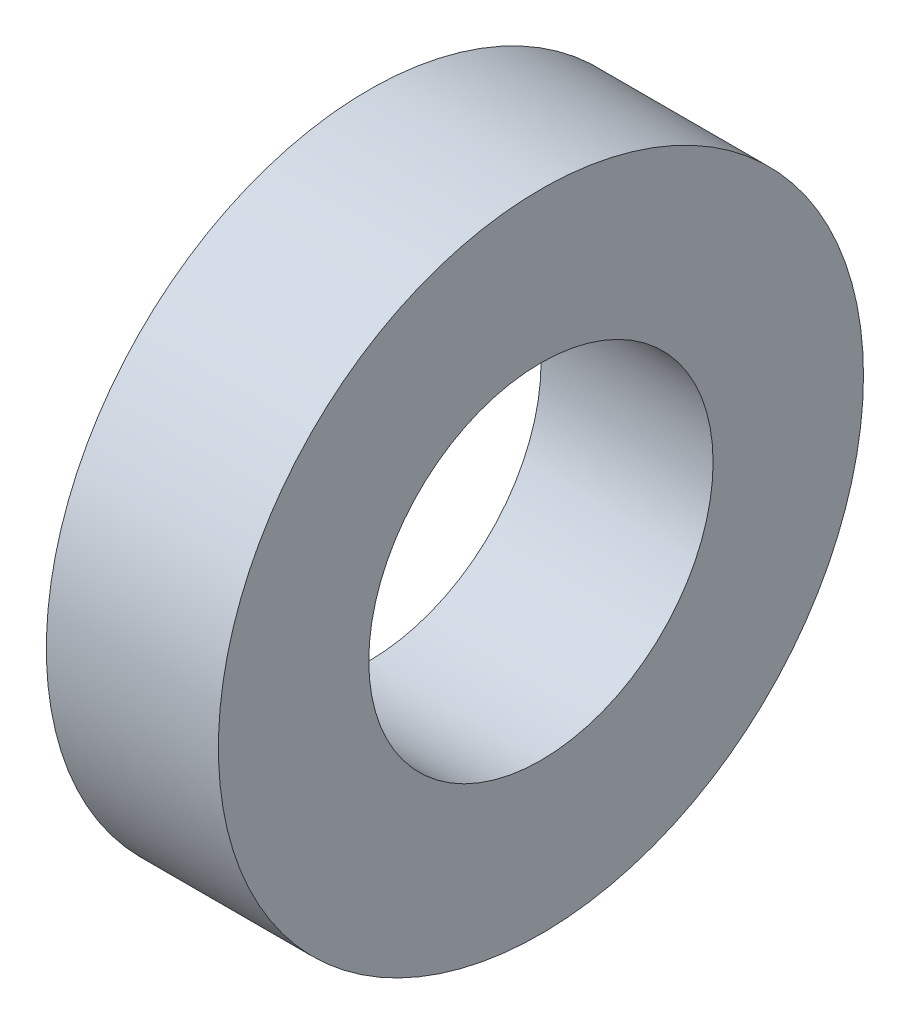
from build123d import *

# Parameters (mm, degrees)
SCHIZZO1_R                   = 7.499558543
SCHIZZO1_R_2                 = 4.00289714
ESTRUSIONE_ESTRUSIONE1_DEPTH = 4


with BuildPart() as part:
    # Schizzo1 → Estrusione-Estrusione1 (new body)
    with BuildSketch(Plane(origin=(0, 0, 0), x_dir=(0, 0, -1), z_dir=(1, 0, 0))):
        Circle(SCHIZZO1_R)
        Circle(SCHIZZO1_R_2, mode=Mode.SUBTRACT)
    extrude(amount=ESTRUSIONE_ESTRUSIONE1_DEPTH)


solid = part.part
